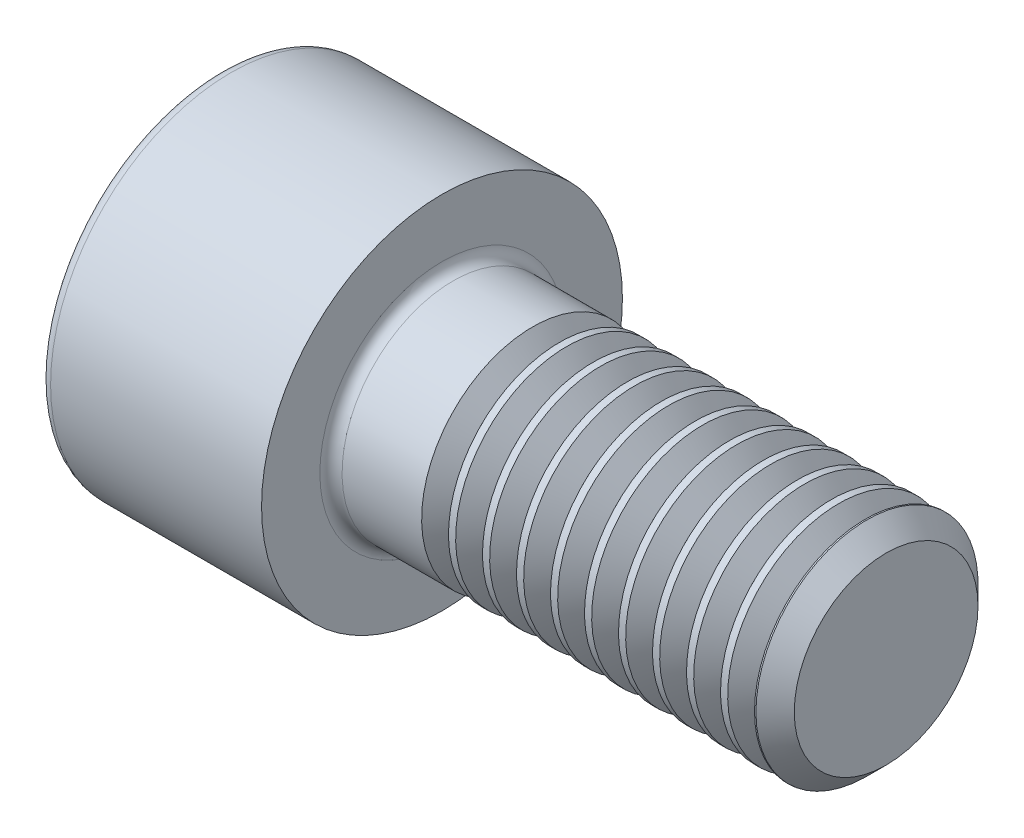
ISO-10303-21;
HEADER;
FILE_DESCRIPTION(('STEP AP214'),'2;1');
FILE_NAME('part.step','',(''),(''),'','','');
FILE_SCHEMA(('AUTOMOTIVE_DESIGN { 1 0 10303 214 1 1 1 1 }'));
ENDSEC;
DATA;
#1=APPLICATION_CONTEXT('core data for automotive mechanical design processes');
#2=APPLICATION_PROTOCOL_DEFINITION('international standard','automotive_design',2000,#1);
#3=PRODUCT_CONTEXT('',#1,'mechanical');
#4=PRODUCT('Part','Part','',(#3));
#5=PRODUCT_RELATED_PRODUCT_CATEGORY('part','',(#4));
#6=PRODUCT_DEFINITION_FORMATION('','',#4);
#7=PRODUCT_DEFINITION_CONTEXT('part definition',#1,'design');
#8=PRODUCT_DEFINITION('design','',#6,#7);
#9=PRODUCT_DEFINITION_SHAPE('','',#8);
#10=(LENGTH_UNIT() NAMED_UNIT(*) SI_UNIT(.MILLI.,.METRE.));
#11=(NAMED_UNIT(*) PLANE_ANGLE_UNIT() SI_UNIT($,.RADIAN.));
#12=(NAMED_UNIT(*) SI_UNIT($,.STERADIAN.) SOLID_ANGLE_UNIT());
#13=UNCERTAINTY_MEASURE_WITH_UNIT(LENGTH_MEASURE(1.E-05),#10,'distance_accuracy_value','');
#14=(GEOMETRIC_REPRESENTATION_CONTEXT(3) GLOBAL_UNCERTAINTY_ASSIGNED_CONTEXT((#13)) GLOBAL_UNIT_ASSIGNED_CONTEXT((#10,
#11,#12)) REPRESENTATION_CONTEXT('',''));
#15=CARTESIAN_POINT('',(0.,0.,0.));
#16=DIRECTION('',(0.,0.,1.));
#17=DIRECTION('',(1.,0.,0.));
#18=AXIS2_PLACEMENT_3D('',#15,#16,#17);
#19=CARTESIAN_POINT('',(0.,0.,0.));
#20=DIRECTION('',(-1.,0.,0.));
#21=DIRECTION('',(0.,0.,1.));
#22=AXIS2_PLACEMENT_3D('',#19,#20,#21);
#23=PLANE('',#22);
#24=DIRECTION('',(0.,-0.499999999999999,0.866025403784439));
#25=VECTOR('',#24,1.);
#26=CARTESIAN_POINT('',(0.,3.51894989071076,0.));
#27=LINE('',#26,#25);
#28=CARTESIAN_POINT('',(0.,3.51894989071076,0.));
#29=VERTEX_POINT('',#28);
#30=CARTESIAN_POINT('',(0.,1.75947494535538,3.04749999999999));
#31=VERTEX_POINT('',#30);
#32=EDGE_CURVE('E408',#29,#31,#27,.T.);
#33=ORIENTED_EDGE('',*,*,#32,.T.);
#34=DIRECTION('',(0.,1.,0.));
#35=VECTOR('',#34,1.);
#36=CARTESIAN_POINT('',(0.,-1.75947494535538,3.0475));
#37=LINE('',#36,#35);
#38=CARTESIAN_POINT('',(0.,-1.75947494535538,3.0475));
#39=VERTEX_POINT('',#38);
#40=EDGE_CURVE('E131',#39,#31,#37,.T.);
#41=ORIENTED_EDGE('',*,*,#40,.F.);
#42=DIRECTION('',(0.,-0.500000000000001,-0.866025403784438));
#43=VECTOR('',#42,1.);
#44=CARTESIAN_POINT('',(0.,-1.75947494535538,3.0475));
#45=LINE('',#44,#43);
#46=CARTESIAN_POINT('',(0.,-3.51894989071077,0.));
#47=VERTEX_POINT('',#46);
#48=EDGE_CURVE('E427',#39,#47,#45,.T.);
#49=ORIENTED_EDGE('',*,*,#48,.T.);
#50=DIRECTION('',(0.,0.499999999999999,-0.866025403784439));
#51=VECTOR('',#50,1.);
#52=CARTESIAN_POINT('',(0.,-3.51894989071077,0.));
#53=LINE('',#52,#51);
#54=CARTESIAN_POINT('',(0.,-1.75947494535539,-3.0475));
#55=VERTEX_POINT('',#54);
#56=EDGE_CURVE('E430',#47,#55,#53,.T.);
#57=ORIENTED_EDGE('',*,*,#56,.T.);
#58=DIRECTION('',(0.,-1.,0.));
#59=VECTOR('',#58,1.);
#60=CARTESIAN_POINT('',(0.,1.75947494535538,-3.0475));
#61=LINE('',#60,#59);
#62=CARTESIAN_POINT('',(0.,1.75947494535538,-3.0475));
#63=VERTEX_POINT('',#62);
#64=EDGE_CURVE('E433',#63,#55,#61,.T.);
#65=ORIENTED_EDGE('',*,*,#64,.F.);
#66=DIRECTION('',(0.,-0.500000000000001,-0.866025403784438));
#67=VECTOR('',#66,1.);
#68=CARTESIAN_POINT('',(0.,3.51894989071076,0.));
#69=LINE('',#68,#67);
#70=EDGE_CURVE('E126',#29,#63,#69,.T.);
#71=ORIENTED_EDGE('',*,*,#70,.F.);
#72=EDGE_LOOP('',(#33,#41,#49,#57,#65,#71));
#73=FACE_BOUND('',#72,.T.);
#74=CARTESIAN_POINT('',(0.,0.,0.));
#75=DIRECTION('',(-1.,0.,0.));
#76=DIRECTION('',(0.,0.,1.));
#77=AXIS2_PLACEMENT_3D('',#74,#75,#76);
#78=CIRCLE('',#77,6.1);
#79=CARTESIAN_POINT('',(0.,0.,6.1));
#80=VERTEX_POINT('',#79);
#81=EDGE_CURVE('E43',#80,#80,#78,.T.);
#82=ORIENTED_EDGE('',*,*,#81,.T.);
#83=EDGE_LOOP('',(#82));
#84=FACE_BOUND('',#83,.T.);
#85=ADVANCED_FACE('F35',(#73,#84),#23,.T.);
#86=CARTESIAN_POINT('',(-31.75,0.,0.));
#87=DIRECTION('',(-1.,0.,0.));
#88=DIRECTION('',(0.,0.,1.));
#89=AXIS2_PLACEMENT_3D('',#86,#87,#88);
#90=CYLINDRICAL_SURFACE('',#89,6.5);
#91=CARTESIAN_POINT('',(0.399999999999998,0.,0.));
#92=DIRECTION('',(-1.,0.,0.));
#93=DIRECTION('',(0.,0.,1.));
#94=AXIS2_PLACEMENT_3D('',#91,#92,#93);
#95=CIRCLE('',#94,6.5);
#96=CARTESIAN_POINT('',(0.399999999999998,0.,6.5));
#97=VERTEX_POINT('',#96);
#98=EDGE_CURVE('E11',#97,#97,#95,.F.);
#99=ORIENTED_EDGE('',*,*,#98,.T.);
#100=EDGE_LOOP('',(#99));
#101=FACE_BOUND('',#100,.T.);
#102=CARTESIAN_POINT('',(8.,0.,0.));
#103=DIRECTION('',(-1.,0.,0.));
#104=DIRECTION('',(0.,0.,1.));
#105=AXIS2_PLACEMENT_3D('',#102,#103,#104);
#106=CIRCLE('',#105,6.5);
#107=CARTESIAN_POINT('',(8.,0.,6.5));
#108=VERTEX_POINT('',#107);
#109=EDGE_CURVE('E149',#108,#108,#106,.T.);
#110=ORIENTED_EDGE('',*,*,#109,.T.);
#111=EDGE_LOOP('',(#110));
#112=FACE_BOUND('',#111,.T.);
#113=ADVANCED_FACE('F173',(#101,#112),#90,.T.);
#114=CARTESIAN_POINT('',(8.,6.5,0.));
#115=DIRECTION('',(1.,0.,0.));
#116=DIRECTION('',(0.,0.,-1.));
#117=AXIS2_PLACEMENT_3D('',#114,#115,#116);
#118=PLANE('',#117);
#119=CARTESIAN_POINT('',(8.,0.,0.));
#120=DIRECTION('',(1.,0.,0.));
#121=DIRECTION('',(0.,0.,-1.));
#122=AXIS2_PLACEMENT_3D('',#119,#120,#121);
#123=CIRCLE('',#122,4.39999999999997);
#124=CARTESIAN_POINT('',(8.,0.,-4.39999999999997));
#125=VERTEX_POINT('',#124);
#126=EDGE_CURVE('E152',#125,#125,#123,.F.);
#127=ORIENTED_EDGE('',*,*,#126,.T.);
#128=EDGE_LOOP('',(#127));
#129=FACE_BOUND('',#128,.T.);
#130=ORIENTED_EDGE('',*,*,#109,.F.);
#131=EDGE_LOOP('',(#130));
#132=FACE_BOUND('',#131,.T.);
#133=ADVANCED_FACE('F179',(#129,#132),#118,.T.);
#134=CARTESIAN_POINT('',(-31.75,0.,0.));
#135=DIRECTION('',(-1.,0.,0.));
#136=DIRECTION('',(0.,0.,1.));
#137=AXIS2_PLACEMENT_3D('',#134,#135,#136);
#138=CYLINDRICAL_SURFACE('',#137,3.99999999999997);
#139=CARTESIAN_POINT('',(11.2665066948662,0.,0.));
#140=DIRECTION('',(-1.,0.,0.));
#141=DIRECTION('',(0.,-1.,0.));
#142=AXIS2_PLACEMENT_3D('',#139,#140,#141);
#143=CIRCLE('',#142,4.);
#144=CARTESIAN_POINT('',(11.2665066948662,-4.,0.));
#145=VERTEX_POINT('',#144);
#146=EDGE_CURVE('E403',#145,#145,#143,.T.);
#147=ORIENTED_EDGE('',*,*,#146,.T.);
#148=EDGE_LOOP('',(#147));
#149=FACE_BOUND('',#148,.T.);
#150=CARTESIAN_POINT('',(8.4,0.,0.));
#151=DIRECTION('',(1.,0.,0.));
#152=DIRECTION('',(0.,0.,-1.));
#153=AXIS2_PLACEMENT_3D('',#150,#151,#152);
#154=CIRCLE('',#153,3.99999999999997);
#155=CARTESIAN_POINT('',(8.4,0.,-3.99999999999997));
#156=VERTEX_POINT('',#155);
#157=EDGE_CURVE('E155',#156,#156,#154,.T.);
#158=ORIENTED_EDGE('',*,*,#157,.T.);
#159=EDGE_LOOP('',(#158));
#160=FACE_BOUND('',#159,.T.);
#161=ADVANCED_FACE('F169',(#149,#160),#138,.T.);
#162=CARTESIAN_POINT('',(8.4,0.,0.));
#163=DIRECTION('',(1.,0.,0.));
#164=DIRECTION('',(0.,0.,-1.));
#165=AXIS2_PLACEMENT_3D('',#162,#163,#164);
#166=TOROIDAL_SURFACE('',#165,4.39999999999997,0.4);
#167=ORIENTED_EDGE('',*,*,#157,.F.);
#168=EDGE_LOOP('',(#167));
#169=FACE_BOUND('',#168,.T.);
#170=ORIENTED_EDGE('',*,*,#126,.F.);
#171=EDGE_LOOP('',(#170));
#172=FACE_BOUND('',#171,.T.);
#173=ADVANCED_FACE('F162',(#169,#172),#166,.F.);
#174=CARTESIAN_POINT('',(0.399999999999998,0.,0.));
#175=DIRECTION('',(-1.,0.,0.));
#176=DIRECTION('',(0.,0.,1.));
#177=AXIS2_PLACEMENT_3D('',#174,#175,#176);
#178=TOROIDAL_SURFACE('',#177,6.1,0.4);
#179=ORIENTED_EDGE('',*,*,#98,.F.);
#180=EDGE_LOOP('',(#179));
#181=FACE_BOUND('',#180,.T.);
#182=ORIENTED_EDGE('',*,*,#81,.F.);
#183=EDGE_LOOP('',(#182));
#184=FACE_BOUND('',#183,.T.);
#185=ADVANCED_FACE('F37',(#181,#184),#178,.T.);
#186=CARTESIAN_POINT('',(4.,3.51894989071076,0.));
#187=DIRECTION('',(0.,-0.866025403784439,-0.499999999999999));
#188=DIRECTION('',(0.,0.499999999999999,-0.866025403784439));
#189=AXIS2_PLACEMENT_3D('',#186,#187,#188);
#190=PLANE('',#189);
#191=ORIENTED_EDGE('',*,*,#32,.F.);
#192=DIRECTION('',(-1.,0.,0.));
#193=VECTOR('',#192,1.);
#194=CARTESIAN_POINT('',(4.,3.51894989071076,0.));
#195=LINE('',#194,#193);
#196=CARTESIAN_POINT('',(4.,3.51894989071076,0.));
#197=VERTEX_POINT('',#196);
#198=EDGE_CURVE('E424',#197,#29,#195,.T.);
#199=ORIENTED_EDGE('',*,*,#198,.F.);
#200=DIRECTION('',(0.,-0.499999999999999,0.866025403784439));
#201=VECTOR('',#200,1.);
#202=CARTESIAN_POINT('',(4.,3.51894989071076,0.));
#203=LINE('',#202,#201);
#204=CARTESIAN_POINT('',(4.,2.63921241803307,1.52374999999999));
#205=VERTEX_POINT('',#204);
#206=EDGE_CURVE('E118',#197,#205,#203,.T.);
#207=ORIENTED_EDGE('',*,*,#206,.T.);
#208=CARTESIAN_POINT('',(4.,1.75947494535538,3.04749999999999));
#209=VERTEX_POINT('',#208);
#210=EDGE_CURVE('E109',#205,#209,#203,.T.);
#211=ORIENTED_EDGE('',*,*,#210,.T.);
#212=DIRECTION('',(-1.,0.,0.));
#213=VECTOR('',#212,1.);
#214=CARTESIAN_POINT('',(4.,1.75947494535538,3.04749999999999));
#215=LINE('',#214,#213);
#216=EDGE_CURVE('E123',#209,#31,#215,.T.);
#217=ORIENTED_EDGE('',*,*,#216,.T.);
#218=EDGE_LOOP('',(#191,#199,#207,#211,#217));
#219=FACE_BOUND('',#218,.T.);
#220=ADVANCED_FACE('F122',(#219),#190,.T.);
#221=CARTESIAN_POINT('',(4.,-1.75947494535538,3.0475));
#222=DIRECTION('',(0.,0.,1.));
#223=DIRECTION('',(0.,-1.,0.));
#224=AXIS2_PLACEMENT_3D('',#221,#222,#223);
#225=PLANE('',#224);
#226=ORIENTED_EDGE('',*,*,#40,.T.);
#227=ORIENTED_EDGE('',*,*,#216,.F.);
#228=DIRECTION('',(0.,1.,0.));
#229=VECTOR('',#228,1.);
#230=CARTESIAN_POINT('',(4.,-1.75947494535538,3.0475));
#231=LINE('',#230,#229);
#232=CARTESIAN_POINT('',(4.,0.,3.0475));
#233=VERTEX_POINT('',#232);
#234=EDGE_CURVE('E106',#233,#209,#231,.T.);
#235=ORIENTED_EDGE('',*,*,#234,.F.);
#236=CARTESIAN_POINT('',(4.,-1.75947494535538,3.0475));
#237=VERTEX_POINT('',#236);
#238=EDGE_CURVE('E117',#237,#233,#231,.T.);
#239=ORIENTED_EDGE('',*,*,#238,.F.);
#240=DIRECTION('',(-1.,0.,0.));
#241=VECTOR('',#240,1.);
#242=CARTESIAN_POINT('',(4.,-1.75947494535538,3.0475));
#243=LINE('',#242,#241);
#244=EDGE_CURVE('E133',#237,#39,#243,.T.);
#245=ORIENTED_EDGE('',*,*,#244,.T.);
#246=EDGE_LOOP('',(#226,#227,#235,#239,#245));
#247=FACE_BOUND('',#246,.T.);
#248=ADVANCED_FACE('F128',(#247),#225,.F.);
#249=CARTESIAN_POINT('',(4.,-1.75947494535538,3.0475));
#250=DIRECTION('',(0.,0.866025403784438,-0.500000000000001));
#251=DIRECTION('',(0.,0.500000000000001,0.866025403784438));
#252=AXIS2_PLACEMENT_3D('',#249,#250,#251);
#253=PLANE('',#252);
#254=ORIENTED_EDGE('',*,*,#48,.F.);
#255=ORIENTED_EDGE('',*,*,#244,.F.);
#256=DIRECTION('',(0.,-0.500000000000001,-0.866025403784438));
#257=VECTOR('',#256,1.);
#258=CARTESIAN_POINT('',(4.,-1.75947494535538,3.0475));
#259=LINE('',#258,#257);
#260=CARTESIAN_POINT('',(4.,-2.63921241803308,1.52375));
#261=VERTEX_POINT('',#260);
#262=EDGE_CURVE('E411',#237,#261,#259,.T.);
#263=ORIENTED_EDGE('',*,*,#262,.T.);
#264=CARTESIAN_POINT('',(4.,-3.51894989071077,0.));
#265=VERTEX_POINT('',#264);
#266=EDGE_CURVE('E410',#261,#265,#259,.T.);
#267=ORIENTED_EDGE('',*,*,#266,.T.);
#268=DIRECTION('',(-1.,0.,0.));
#269=VECTOR('',#268,1.);
#270=CARTESIAN_POINT('',(4.,-3.51894989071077,0.));
#271=LINE('',#270,#269);
#272=EDGE_CURVE('E138',#265,#47,#271,.T.);
#273=ORIENTED_EDGE('',*,*,#272,.T.);
#274=EDGE_LOOP('',(#254,#255,#263,#267,#273));
#275=FACE_BOUND('',#274,.T.);
#276=ADVANCED_FACE('F207',(#275),#253,.T.);
#277=CARTESIAN_POINT('',(4.,-3.51894989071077,0.));
#278=DIRECTION('',(0.,0.866025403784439,0.499999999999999));
#279=DIRECTION('',(0.,-0.499999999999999,0.866025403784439));
#280=AXIS2_PLACEMENT_3D('',#277,#278,#279);
#281=PLANE('',#280);
#282=ORIENTED_EDGE('',*,*,#56,.F.);
#283=ORIENTED_EDGE('',*,*,#272,.F.);
#284=DIRECTION('',(0.,0.499999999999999,-0.866025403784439));
#285=VECTOR('',#284,1.);
#286=CARTESIAN_POINT('',(4.,-3.51894989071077,0.));
#287=LINE('',#286,#285);
#288=CARTESIAN_POINT('',(4.,-2.63921241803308,-1.52375));
#289=VERTEX_POINT('',#288);
#290=EDGE_CURVE('E415',#265,#289,#287,.T.);
#291=ORIENTED_EDGE('',*,*,#290,.T.);
#292=CARTESIAN_POINT('',(4.,-1.75947494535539,-3.0475));
#293=VERTEX_POINT('',#292);
#294=EDGE_CURVE('E414',#289,#293,#287,.T.);
#295=ORIENTED_EDGE('',*,*,#294,.T.);
#296=DIRECTION('',(-1.,0.,0.));
#297=VECTOR('',#296,1.);
#298=CARTESIAN_POINT('',(4.,-1.75947494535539,-3.0475));
#299=LINE('',#298,#297);
#300=EDGE_CURVE('E442',#293,#55,#299,.T.);
#301=ORIENTED_EDGE('',*,*,#300,.T.);
#302=EDGE_LOOP('',(#282,#283,#291,#295,#301));
#303=FACE_BOUND('',#302,.T.);
#304=ADVANCED_FACE('F210',(#303),#281,.T.);
#305=CARTESIAN_POINT('',(4.,1.75947494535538,-3.0475));
#306=DIRECTION('',(0.,0.,-1.));
#307=DIRECTION('',(0.,1.,0.));
#308=AXIS2_PLACEMENT_3D('',#305,#306,#307);
#309=PLANE('',#308);
#310=ORIENTED_EDGE('',*,*,#64,.T.);
#311=ORIENTED_EDGE('',*,*,#300,.F.);
#312=DIRECTION('',(0.,-1.,0.));
#313=VECTOR('',#312,1.);
#314=CARTESIAN_POINT('',(4.,1.75947494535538,-3.0475));
#315=LINE('',#314,#313);
#316=CARTESIAN_POINT('',(4.,0.,-3.0475));
#317=VERTEX_POINT('',#316);
#318=EDGE_CURVE('E418',#317,#293,#315,.T.);
#319=ORIENTED_EDGE('',*,*,#318,.F.);
#320=CARTESIAN_POINT('',(4.,1.75947494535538,-3.0475));
#321=VERTEX_POINT('',#320);
#322=EDGE_CURVE('E50',#321,#317,#315,.T.);
#323=ORIENTED_EDGE('',*,*,#322,.F.);
#324=DIRECTION('',(-1.,0.,0.));
#325=VECTOR('',#324,1.);
#326=CARTESIAN_POINT('',(4.,1.75947494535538,-3.0475));
#327=LINE('',#326,#325);
#328=EDGE_CURVE('E439',#321,#63,#327,.T.);
#329=ORIENTED_EDGE('',*,*,#328,.T.);
#330=EDGE_LOOP('',(#310,#311,#319,#323,#329));
#331=FACE_BOUND('',#330,.T.);
#332=ADVANCED_FACE('F214',(#331),#309,.F.);
#333=CARTESIAN_POINT('',(4.,3.51894989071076,0.));
#334=DIRECTION('',(0.,0.866025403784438,-0.500000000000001));
#335=DIRECTION('',(0.,0.500000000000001,0.866025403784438));
#336=AXIS2_PLACEMENT_3D('',#333,#334,#335);
#337=PLANE('',#336);
#338=ORIENTED_EDGE('',*,*,#70,.T.);
#339=ORIENTED_EDGE('',*,*,#328,.F.);
#340=DIRECTION('',(0.,-0.500000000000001,-0.866025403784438));
#341=VECTOR('',#340,1.);
#342=CARTESIAN_POINT('',(4.,3.51894989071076,0.));
#343=LINE('',#342,#341);
#344=CARTESIAN_POINT('',(4.,2.63921241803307,-1.52375));
#345=VERTEX_POINT('',#344);
#346=EDGE_CURVE('E420',#345,#321,#343,.T.);
#347=ORIENTED_EDGE('',*,*,#346,.F.);
#348=EDGE_CURVE('E421',#197,#345,#343,.T.);
#349=ORIENTED_EDGE('',*,*,#348,.F.);
#350=ORIENTED_EDGE('',*,*,#198,.T.);
#351=EDGE_LOOP('',(#338,#339,#347,#349,#350));
#352=FACE_BOUND('',#351,.T.);
#353=ADVANCED_FACE('F218',(#352),#337,.F.);
#354=CARTESIAN_POINT('',(4.,3.51894989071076,0.));
#355=DIRECTION('',(1.,0.,0.));
#356=DIRECTION('',(0.,0.,-1.));
#357=AXIS2_PLACEMENT_3D('',#354,#355,#356);
#358=PLANE('',#357);
#359=ORIENTED_EDGE('',*,*,#318,.T.);
#360=ORIENTED_EDGE('',*,*,#294,.F.);
#361=CARTESIAN_POINT('',(4.,0.,0.));
#362=DIRECTION('',(-1.,0.,0.));
#363=DIRECTION('',(0.,0.,1.));
#364=AXIS2_PLACEMENT_3D('',#361,#362,#363);
#365=CIRCLE('',#364,3.0475);
#366=EDGE_CURVE('E459',#317,#289,#365,.T.);
#367=ORIENTED_EDGE('',*,*,#366,.F.);
#368=EDGE_LOOP('',(#359,#360,#367));
#369=FACE_BOUND('',#368,.T.);
#370=ADVANCED_FACE('F222',(#369),#358,.F.);
#371=ORIENTED_EDGE('',*,*,#290,.F.);
#372=ORIENTED_EDGE('',*,*,#266,.F.);
#373=EDGE_CURVE('E136',#289,#261,#365,.T.);
#374=ORIENTED_EDGE('',*,*,#373,.F.);
#375=EDGE_LOOP('',(#371,#372,#374));
#376=FACE_BOUND('',#375,.T.);
#377=ADVANCED_FACE('F226',(#376),#358,.F.);
#378=ORIENTED_EDGE('',*,*,#262,.F.);
#379=ORIENTED_EDGE('',*,*,#238,.T.);
#380=EDGE_CURVE('E132',#261,#233,#365,.T.);
#381=ORIENTED_EDGE('',*,*,#380,.F.);
#382=EDGE_LOOP('',(#378,#379,#381));
#383=FACE_BOUND('',#382,.T.);
#384=ADVANCED_FACE('F468',(#383),#358,.F.);
#385=ORIENTED_EDGE('',*,*,#234,.T.);
#386=ORIENTED_EDGE('',*,*,#210,.F.);
#387=EDGE_CURVE('E112',#233,#205,#365,.T.);
#388=ORIENTED_EDGE('',*,*,#387,.F.);
#389=EDGE_LOOP('',(#385,#386,#388));
#390=FACE_BOUND('',#389,.T.);
#391=ADVANCED_FACE('F108',(#390),#358,.F.);
#392=ORIENTED_EDGE('',*,*,#206,.F.);
#393=ORIENTED_EDGE('',*,*,#348,.T.);
#394=EDGE_CURVE('E143',#205,#345,#365,.T.);
#395=ORIENTED_EDGE('',*,*,#394,.F.);
#396=EDGE_LOOP('',(#392,#393,#395));
#397=FACE_BOUND('',#396,.T.);
#398=ADVANCED_FACE('F454',(#397),#358,.F.);
#399=ORIENTED_EDGE('',*,*,#346,.T.);
#400=ORIENTED_EDGE('',*,*,#322,.T.);
#401=EDGE_CURVE('E458',#345,#317,#365,.T.);
#402=ORIENTED_EDGE('',*,*,#401,.F.);
#403=EDGE_LOOP('',(#399,#400,#402));
#404=FACE_BOUND('',#403,.T.);
#405=ADVANCED_FACE('F203',(#404),#358,.F.);
#406=CARTESIAN_POINT('',(4.,0.,0.));
#407=DIRECTION('',(-1.,0.,0.));
#408=DIRECTION('',(0.,0.,1.));
#409=AXIS2_PLACEMENT_3D('',#406,#407,#408);
#410=CONICAL_SURFACE('',#409,3.0475,1.04719755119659);
#411=CARTESIAN_POINT('',(5.75947494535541,0.,0.));
#412=VERTEX_POINT('',#411);
#413=VERTEX_LOOP('',#412);
#414=FACE_BOUND('',#413,.T.);
#415=ORIENTED_EDGE('',*,*,#387,.T.);
#416=ORIENTED_EDGE('',*,*,#394,.T.);
#417=ORIENTED_EDGE('',*,*,#401,.T.);
#418=ORIENTED_EDGE('',*,*,#366,.T.);
#419=ORIENTED_EDGE('',*,*,#373,.T.);
#420=ORIENTED_EDGE('',*,*,#380,.T.);
#421=EDGE_LOOP('',(#415,#416,#417,#418,#419,#420));
#422=FACE_BOUND('',#421,.T.);
#423=ADVANCED_FACE('F200',(#414,#422),#410,.F.);
#424=CARTESIAN_POINT('',(12.2334933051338,0.,0.));
#425=DIRECTION('',(1.,0.,0.));
#426=DIRECTION('',(0.,1.,0.));
#427=AXIS2_PLACEMENT_3D('',#424,#425,#426);
#428=CONICAL_SURFACE('',#427,4.,0.959931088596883);
#429=CARTESIAN_POINT('',(11.75,0.,0.));
#430=DIRECTION('',(-1.,0.,0.));
#431=DIRECTION('',(0.,-1.,0.));
#432=AXIS2_PLACEMENT_3D('',#429,#430,#431);
#433=CIRCLE('',#432,3.3095);
#434=CARTESIAN_POINT('',(11.75,-3.3095,0.));
#435=VERTEX_POINT('',#434);
#436=EDGE_CURVE('E400',#435,#435,#433,.T.);
#437=ORIENTED_EDGE('',*,*,#436,.F.);
#438=EDGE_LOOP('',(#437));
#439=FACE_BOUND('',#438,.T.);
#440=CARTESIAN_POINT('',(12.2334933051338,0.,0.));
#441=DIRECTION('',(-1.,0.,0.));
#442=DIRECTION('',(0.,-1.,0.));
#443=AXIS2_PLACEMENT_3D('',#440,#441,#442);
#444=CIRCLE('',#443,4.);
#445=CARTESIAN_POINT('',(12.2334933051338,-4.,0.));
#446=VERTEX_POINT('',#445);
#447=EDGE_CURVE('E406',#446,#446,#444,.T.);
#448=ORIENTED_EDGE('',*,*,#447,.T.);
#449=EDGE_LOOP('',(#448));
#450=FACE_BOUND('',#449,.T.);
#451=ADVANCED_FACE('F202',(#439,#450),#428,.T.);
#452=CARTESIAN_POINT('',(11.75,0.,0.));
#453=DIRECTION('',(-1.,0.,0.));
#454=DIRECTION('',(0.,-1.,0.));
#455=AXIS2_PLACEMENT_3D('',#452,#453,#454);
#456=CONICAL_SURFACE('',#455,3.3095,0.959931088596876);
#457=ORIENTED_EDGE('',*,*,#146,.F.);
#458=EDGE_LOOP('',(#457));
#459=FACE_BOUND('',#458,.T.);
#460=ORIENTED_EDGE('',*,*,#436,.T.);
#461=EDGE_LOOP('',(#460));
#462=FACE_BOUND('',#461,.T.);
#463=ADVANCED_FACE('F230',(#459,#462),#456,.T.);
#464=CARTESIAN_POINT('',(12.4915066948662,0.,0.));
#465=DIRECTION('',(-1.,0.,0.));
#466=DIRECTION('',(0.,-1.,0.));
#467=AXIS2_PLACEMENT_3D('',#464,#465,#466);
#468=CIRCLE('',#467,4.);
#469=CARTESIAN_POINT('',(12.4915066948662,-4.,0.));
#470=VERTEX_POINT('',#469);
#471=EDGE_CURVE('E394',#470,#470,#468,.T.);
#472=ORIENTED_EDGE('',*,*,#471,.T.);
#473=EDGE_LOOP('',(#472));
#474=FACE_BOUND('',#473,.T.);
#475=ORIENTED_EDGE('',*,*,#447,.F.);
#476=EDGE_LOOP('',(#475));
#477=FACE_BOUND('',#476,.T.);
#478=ADVANCED_FACE('F190',(#474,#477),#138,.T.);
#479=CARTESIAN_POINT('',(13.4584933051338,0.,0.));
#480=DIRECTION('',(1.,0.,0.));
#481=DIRECTION('',(0.,1.,0.));
#482=AXIS2_PLACEMENT_3D('',#479,#480,#481);
#483=CONICAL_SURFACE('',#482,4.,0.959931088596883);
#484=CARTESIAN_POINT('',(12.975,0.,0.));
#485=DIRECTION('',(-1.,0.,0.));
#486=DIRECTION('',(0.,-1.,0.));
#487=AXIS2_PLACEMENT_3D('',#484,#485,#486);
#488=CIRCLE('',#487,3.3095);
#489=CARTESIAN_POINT('',(12.975,-3.3095,0.));
#490=VERTEX_POINT('',#489);
#491=EDGE_CURVE('E391',#490,#490,#488,.T.);
#492=ORIENTED_EDGE('',*,*,#491,.F.);
#493=EDGE_LOOP('',(#492));
#494=FACE_BOUND('',#493,.T.);
#495=CARTESIAN_POINT('',(13.4584933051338,0.,0.));
#496=DIRECTION('',(-1.,0.,0.));
#497=DIRECTION('',(0.,-1.,0.));
#498=AXIS2_PLACEMENT_3D('',#495,#496,#497);
#499=CIRCLE('',#498,4.);
#500=CARTESIAN_POINT('',(13.4584933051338,-4.,0.));
#501=VERTEX_POINT('',#500);
#502=EDGE_CURVE('E397',#501,#501,#499,.T.);
#503=ORIENTED_EDGE('',*,*,#502,.T.);
#504=EDGE_LOOP('',(#503));
#505=FACE_BOUND('',#504,.T.);
#506=ADVANCED_FACE('F235',(#494,#505),#483,.T.);
#507=CARTESIAN_POINT('',(12.975,0.,0.));
#508=DIRECTION('',(-1.,0.,0.));
#509=DIRECTION('',(0.,-1.,0.));
#510=AXIS2_PLACEMENT_3D('',#507,#508,#509);
#511=CONICAL_SURFACE('',#510,3.3095,0.959931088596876);
#512=ORIENTED_EDGE('',*,*,#471,.F.);
#513=EDGE_LOOP('',(#512));
#514=FACE_BOUND('',#513,.T.);
#515=ORIENTED_EDGE('',*,*,#491,.T.);
#516=EDGE_LOOP('',(#515));
#517=FACE_BOUND('',#516,.T.);
#518=ADVANCED_FACE('F238',(#514,#517),#511,.T.);
#519=CARTESIAN_POINT('',(13.7165066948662,0.,0.));
#520=DIRECTION('',(-1.,0.,0.));
#521=DIRECTION('',(0.,-1.,0.));
#522=AXIS2_PLACEMENT_3D('',#519,#520,#521);
#523=CIRCLE('',#522,4.);
#524=CARTESIAN_POINT('',(13.7165066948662,-4.,0.));
#525=VERTEX_POINT('',#524);
#526=EDGE_CURVE('E385',#525,#525,#523,.T.);
#527=ORIENTED_EDGE('',*,*,#526,.T.);
#528=EDGE_LOOP('',(#527));
#529=FACE_BOUND('',#528,.T.);
#530=ORIENTED_EDGE('',*,*,#502,.F.);
#531=EDGE_LOOP('',(#530));
#532=FACE_BOUND('',#531,.T.);
#533=ADVANCED_FACE('F242',(#529,#532),#138,.T.);
#534=CARTESIAN_POINT('',(14.6834933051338,0.,0.));
#535=DIRECTION('',(1.,0.,0.));
#536=DIRECTION('',(0.,1.,0.));
#537=AXIS2_PLACEMENT_3D('',#534,#535,#536);
#538=CONICAL_SURFACE('',#537,4.,0.959931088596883);
#539=CARTESIAN_POINT('',(14.2,0.,0.));
#540=DIRECTION('',(-1.,0.,0.));
#541=DIRECTION('',(0.,-1.,0.));
#542=AXIS2_PLACEMENT_3D('',#539,#540,#541);
#543=CIRCLE('',#542,3.3095);
#544=CARTESIAN_POINT('',(14.2,-3.3095,0.));
#545=VERTEX_POINT('',#544);
#546=EDGE_CURVE('E382',#545,#545,#543,.T.);
#547=ORIENTED_EDGE('',*,*,#546,.F.);
#548=EDGE_LOOP('',(#547));
#549=FACE_BOUND('',#548,.T.);
#550=CARTESIAN_POINT('',(14.6834933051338,0.,0.));
#551=DIRECTION('',(-1.,0.,0.));
#552=DIRECTION('',(0.,-1.,0.));
#553=AXIS2_PLACEMENT_3D('',#550,#551,#552);
#554=CIRCLE('',#553,4.);
#555=CARTESIAN_POINT('',(14.6834933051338,-4.,0.));
#556=VERTEX_POINT('',#555);
#557=EDGE_CURVE('E388',#556,#556,#554,.T.);
#558=ORIENTED_EDGE('',*,*,#557,.T.);
#559=EDGE_LOOP('',(#558));
#560=FACE_BOUND('',#559,.T.);
#561=ADVANCED_FACE('F244',(#549,#560),#538,.T.);
#562=CARTESIAN_POINT('',(14.2,0.,0.));
#563=DIRECTION('',(-1.,0.,0.));
#564=DIRECTION('',(0.,-1.,0.));
#565=AXIS2_PLACEMENT_3D('',#562,#563,#564);
#566=CONICAL_SURFACE('',#565,3.3095,0.959931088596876);
#567=ORIENTED_EDGE('',*,*,#526,.F.);
#568=EDGE_LOOP('',(#567));
#569=FACE_BOUND('',#568,.T.);
#570=ORIENTED_EDGE('',*,*,#546,.T.);
#571=EDGE_LOOP('',(#570));
#572=FACE_BOUND('',#571,.T.);
#573=ADVANCED_FACE('F247',(#569,#572),#566,.T.);
#574=CARTESIAN_POINT('',(14.9415066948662,0.,0.));
#575=DIRECTION('',(-1.,0.,0.));
#576=DIRECTION('',(0.,-1.,0.));
#577=AXIS2_PLACEMENT_3D('',#574,#575,#576);
#578=CIRCLE('',#577,4.);
#579=CARTESIAN_POINT('',(14.9415066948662,-4.,0.));
#580=VERTEX_POINT('',#579);
#581=EDGE_CURVE('E376',#580,#580,#578,.T.);
#582=ORIENTED_EDGE('',*,*,#581,.T.);
#583=EDGE_LOOP('',(#582));
#584=FACE_BOUND('',#583,.T.);
#585=ORIENTED_EDGE('',*,*,#557,.F.);
#586=EDGE_LOOP('',(#585));
#587=FACE_BOUND('',#586,.T.);
#588=ADVANCED_FACE('F251',(#584,#587),#138,.T.);
#589=CARTESIAN_POINT('',(15.9084933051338,0.,0.));
#590=DIRECTION('',(1.,0.,0.));
#591=DIRECTION('',(0.,1.,0.));
#592=AXIS2_PLACEMENT_3D('',#589,#590,#591);
#593=CONICAL_SURFACE('',#592,4.,0.959931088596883);
#594=CARTESIAN_POINT('',(15.425,0.,0.));
#595=DIRECTION('',(-1.,0.,0.));
#596=DIRECTION('',(0.,-1.,0.));
#597=AXIS2_PLACEMENT_3D('',#594,#595,#596);
#598=CIRCLE('',#597,3.3095);
#599=CARTESIAN_POINT('',(15.425,-3.3095,0.));
#600=VERTEX_POINT('',#599);
#601=EDGE_CURVE('E373',#600,#600,#598,.T.);
#602=ORIENTED_EDGE('',*,*,#601,.F.);
#603=EDGE_LOOP('',(#602));
#604=FACE_BOUND('',#603,.T.);
#605=CARTESIAN_POINT('',(15.9084933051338,0.,0.));
#606=DIRECTION('',(-1.,0.,0.));
#607=DIRECTION('',(0.,-1.,0.));
#608=AXIS2_PLACEMENT_3D('',#605,#606,#607);
#609=CIRCLE('',#608,4.);
#610=CARTESIAN_POINT('',(15.9084933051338,-4.,0.));
#611=VERTEX_POINT('',#610);
#612=EDGE_CURVE('E379',#611,#611,#609,.T.);
#613=ORIENTED_EDGE('',*,*,#612,.T.);
#614=EDGE_LOOP('',(#613));
#615=FACE_BOUND('',#614,.T.);
#616=ADVANCED_FACE('F253',(#604,#615),#593,.T.);
#617=CARTESIAN_POINT('',(15.425,0.,0.));
#618=DIRECTION('',(-1.,0.,0.));
#619=DIRECTION('',(0.,-1.,0.));
#620=AXIS2_PLACEMENT_3D('',#617,#618,#619);
#621=CONICAL_SURFACE('',#620,3.3095,0.959931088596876);
#622=ORIENTED_EDGE('',*,*,#581,.F.);
#623=EDGE_LOOP('',(#622));
#624=FACE_BOUND('',#623,.T.);
#625=ORIENTED_EDGE('',*,*,#601,.T.);
#626=EDGE_LOOP('',(#625));
#627=FACE_BOUND('',#626,.T.);
#628=ADVANCED_FACE('F256',(#624,#627),#621,.T.);
#629=CARTESIAN_POINT('',(16.1665066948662,0.,0.));
#630=DIRECTION('',(-1.,0.,0.));
#631=DIRECTION('',(0.,-1.,0.));
#632=AXIS2_PLACEMENT_3D('',#629,#630,#631);
#633=CIRCLE('',#632,4.);
#634=CARTESIAN_POINT('',(16.1665066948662,-4.,0.));
#635=VERTEX_POINT('',#634);
#636=EDGE_CURVE('E367',#635,#635,#633,.T.);
#637=ORIENTED_EDGE('',*,*,#636,.T.);
#638=EDGE_LOOP('',(#637));
#639=FACE_BOUND('',#638,.T.);
#640=ORIENTED_EDGE('',*,*,#612,.F.);
#641=EDGE_LOOP('',(#640));
#642=FACE_BOUND('',#641,.T.);
#643=ADVANCED_FACE('F260',(#639,#642),#138,.T.);
#644=CARTESIAN_POINT('',(17.1334933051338,0.,0.));
#645=DIRECTION('',(1.,0.,0.));
#646=DIRECTION('',(0.,1.,0.));
#647=AXIS2_PLACEMENT_3D('',#644,#645,#646);
#648=CONICAL_SURFACE('',#647,4.,0.959931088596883);
#649=CARTESIAN_POINT('',(16.65,0.,0.));
#650=DIRECTION('',(-1.,0.,0.));
#651=DIRECTION('',(0.,-1.,0.));
#652=AXIS2_PLACEMENT_3D('',#649,#650,#651);
#653=CIRCLE('',#652,3.3095);
#654=CARTESIAN_POINT('',(16.65,-3.3095,0.));
#655=VERTEX_POINT('',#654);
#656=EDGE_CURVE('E364',#655,#655,#653,.T.);
#657=ORIENTED_EDGE('',*,*,#656,.F.);
#658=EDGE_LOOP('',(#657));
#659=FACE_BOUND('',#658,.T.);
#660=CARTESIAN_POINT('',(17.1334933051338,0.,0.));
#661=DIRECTION('',(-1.,0.,0.));
#662=DIRECTION('',(0.,-1.,0.));
#663=AXIS2_PLACEMENT_3D('',#660,#661,#662);
#664=CIRCLE('',#663,4.);
#665=CARTESIAN_POINT('',(17.1334933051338,-4.,0.));
#666=VERTEX_POINT('',#665);
#667=EDGE_CURVE('E370',#666,#666,#664,.T.);
#668=ORIENTED_EDGE('',*,*,#667,.T.);
#669=EDGE_LOOP('',(#668));
#670=FACE_BOUND('',#669,.T.);
#671=ADVANCED_FACE('F262',(#659,#670),#648,.T.);
#672=CARTESIAN_POINT('',(16.65,0.,0.));
#673=DIRECTION('',(-1.,0.,0.));
#674=DIRECTION('',(0.,-1.,0.));
#675=AXIS2_PLACEMENT_3D('',#672,#673,#674);
#676=CONICAL_SURFACE('',#675,3.3095,0.959931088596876);
#677=ORIENTED_EDGE('',*,*,#636,.F.);
#678=EDGE_LOOP('',(#677));
#679=FACE_BOUND('',#678,.T.);
#680=ORIENTED_EDGE('',*,*,#656,.T.);
#681=EDGE_LOOP('',(#680));
#682=FACE_BOUND('',#681,.T.);
#683=ADVANCED_FACE('F265',(#679,#682),#676,.T.);
#684=CARTESIAN_POINT('',(17.3915066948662,0.,0.));
#685=DIRECTION('',(-1.,0.,0.));
#686=DIRECTION('',(0.,-1.,0.));
#687=AXIS2_PLACEMENT_3D('',#684,#685,#686);
#688=CIRCLE('',#687,4.);
#689=CARTESIAN_POINT('',(17.3915066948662,-4.,0.));
#690=VERTEX_POINT('',#689);
#691=EDGE_CURVE('E358',#690,#690,#688,.T.);
#692=ORIENTED_EDGE('',*,*,#691,.T.);
#693=EDGE_LOOP('',(#692));
#694=FACE_BOUND('',#693,.T.);
#695=ORIENTED_EDGE('',*,*,#667,.F.);
#696=EDGE_LOOP('',(#695));
#697=FACE_BOUND('',#696,.T.);
#698=ADVANCED_FACE('F269',(#694,#697),#138,.T.);
#699=CARTESIAN_POINT('',(18.3584933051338,0.,0.));
#700=DIRECTION('',(1.,0.,0.));
#701=DIRECTION('',(0.,1.,0.));
#702=AXIS2_PLACEMENT_3D('',#699,#700,#701);
#703=CONICAL_SURFACE('',#702,4.,0.959931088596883);
#704=CARTESIAN_POINT('',(17.875,0.,0.));
#705=DIRECTION('',(-1.,0.,0.));
#706=DIRECTION('',(0.,-1.,0.));
#707=AXIS2_PLACEMENT_3D('',#704,#705,#706);
#708=CIRCLE('',#707,3.3095);
#709=CARTESIAN_POINT('',(17.875,-3.3095,0.));
#710=VERTEX_POINT('',#709);
#711=EDGE_CURVE('E355',#710,#710,#708,.T.);
#712=ORIENTED_EDGE('',*,*,#711,.F.);
#713=EDGE_LOOP('',(#712));
#714=FACE_BOUND('',#713,.T.);
#715=CARTESIAN_POINT('',(18.3584933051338,0.,0.));
#716=DIRECTION('',(-1.,0.,0.));
#717=DIRECTION('',(0.,-1.,0.));
#718=AXIS2_PLACEMENT_3D('',#715,#716,#717);
#719=CIRCLE('',#718,4.);
#720=CARTESIAN_POINT('',(18.3584933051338,-4.,0.));
#721=VERTEX_POINT('',#720);
#722=EDGE_CURVE('E361',#721,#721,#719,.T.);
#723=ORIENTED_EDGE('',*,*,#722,.T.);
#724=EDGE_LOOP('',(#723));
#725=FACE_BOUND('',#724,.T.);
#726=ADVANCED_FACE('F271',(#714,#725),#703,.T.);
#727=CARTESIAN_POINT('',(17.875,0.,0.));
#728=DIRECTION('',(-1.,0.,0.));
#729=DIRECTION('',(0.,-1.,0.));
#730=AXIS2_PLACEMENT_3D('',#727,#728,#729);
#731=CONICAL_SURFACE('',#730,3.3095,0.959931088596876);
#732=ORIENTED_EDGE('',*,*,#691,.F.);
#733=EDGE_LOOP('',(#732));
#734=FACE_BOUND('',#733,.T.);
#735=ORIENTED_EDGE('',*,*,#711,.T.);
#736=EDGE_LOOP('',(#735));
#737=FACE_BOUND('',#736,.T.);
#738=ADVANCED_FACE('F274',(#734,#737),#731,.T.);
#739=CARTESIAN_POINT('',(18.6165066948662,0.,0.));
#740=DIRECTION('',(-1.,0.,0.));
#741=DIRECTION('',(0.,-1.,0.));
#742=AXIS2_PLACEMENT_3D('',#739,#740,#741);
#743=CIRCLE('',#742,4.);
#744=CARTESIAN_POINT('',(18.6165066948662,-4.,0.));
#745=VERTEX_POINT('',#744);
#746=EDGE_CURVE('E349',#745,#745,#743,.T.);
#747=ORIENTED_EDGE('',*,*,#746,.T.);
#748=EDGE_LOOP('',(#747));
#749=FACE_BOUND('',#748,.T.);
#750=ORIENTED_EDGE('',*,*,#722,.F.);
#751=EDGE_LOOP('',(#750));
#752=FACE_BOUND('',#751,.T.);
#753=ADVANCED_FACE('F278',(#749,#752),#138,.T.);
#754=CARTESIAN_POINT('',(19.5834933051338,0.,0.));
#755=DIRECTION('',(1.,0.,0.));
#756=DIRECTION('',(0.,1.,0.));
#757=AXIS2_PLACEMENT_3D('',#754,#755,#756);
#758=CONICAL_SURFACE('',#757,4.,0.959931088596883);
#759=CARTESIAN_POINT('',(19.1,0.,0.));
#760=DIRECTION('',(-1.,0.,0.));
#761=DIRECTION('',(0.,-1.,0.));
#762=AXIS2_PLACEMENT_3D('',#759,#760,#761);
#763=CIRCLE('',#762,3.3095);
#764=CARTESIAN_POINT('',(19.1,-3.3095,0.));
#765=VERTEX_POINT('',#764);
#766=EDGE_CURVE('E346',#765,#765,#763,.T.);
#767=ORIENTED_EDGE('',*,*,#766,.F.);
#768=EDGE_LOOP('',(#767));
#769=FACE_BOUND('',#768,.T.);
#770=CARTESIAN_POINT('',(19.5834933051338,0.,0.));
#771=DIRECTION('',(-1.,0.,0.));
#772=DIRECTION('',(0.,-1.,0.));
#773=AXIS2_PLACEMENT_3D('',#770,#771,#772);
#774=CIRCLE('',#773,4.);
#775=CARTESIAN_POINT('',(19.5834933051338,-4.,0.));
#776=VERTEX_POINT('',#775);
#777=EDGE_CURVE('E352',#776,#776,#774,.T.);
#778=ORIENTED_EDGE('',*,*,#777,.T.);
#779=EDGE_LOOP('',(#778));
#780=FACE_BOUND('',#779,.T.);
#781=ADVANCED_FACE('F280',(#769,#780),#758,.T.);
#782=CARTESIAN_POINT('',(19.1,0.,0.));
#783=DIRECTION('',(-1.,0.,0.));
#784=DIRECTION('',(0.,-1.,0.));
#785=AXIS2_PLACEMENT_3D('',#782,#783,#784);
#786=CONICAL_SURFACE('',#785,3.3095,0.959931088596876);
#787=ORIENTED_EDGE('',*,*,#746,.F.);
#788=EDGE_LOOP('',(#787));
#789=FACE_BOUND('',#788,.T.);
#790=ORIENTED_EDGE('',*,*,#766,.T.);
#791=EDGE_LOOP('',(#790));
#792=FACE_BOUND('',#791,.T.);
#793=ADVANCED_FACE('F283',(#789,#792),#786,.T.);
#794=CARTESIAN_POINT('',(19.8415066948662,0.,0.));
#795=DIRECTION('',(-1.,0.,0.));
#796=DIRECTION('',(0.,-1.,0.));
#797=AXIS2_PLACEMENT_3D('',#794,#795,#796);
#798=CIRCLE('',#797,4.);
#799=CARTESIAN_POINT('',(19.8415066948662,-4.,0.));
#800=VERTEX_POINT('',#799);
#801=EDGE_CURVE('E340',#800,#800,#798,.T.);
#802=ORIENTED_EDGE('',*,*,#801,.T.);
#803=EDGE_LOOP('',(#802));
#804=FACE_BOUND('',#803,.T.);
#805=ORIENTED_EDGE('',*,*,#777,.F.);
#806=EDGE_LOOP('',(#805));
#807=FACE_BOUND('',#806,.T.);
#808=ADVANCED_FACE('F287',(#804,#807),#138,.T.);
#809=CARTESIAN_POINT('',(20.8084933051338,0.,0.));
#810=DIRECTION('',(1.,0.,0.));
#811=DIRECTION('',(0.,1.,0.));
#812=AXIS2_PLACEMENT_3D('',#809,#810,#811);
#813=CONICAL_SURFACE('',#812,4.,0.959931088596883);
#814=CARTESIAN_POINT('',(20.325,0.,0.));
#815=DIRECTION('',(-1.,0.,0.));
#816=DIRECTION('',(0.,-1.,0.));
#817=AXIS2_PLACEMENT_3D('',#814,#815,#816);
#818=CIRCLE('',#817,3.3095);
#819=CARTESIAN_POINT('',(20.325,-3.3095,0.));
#820=VERTEX_POINT('',#819);
#821=EDGE_CURVE('E337',#820,#820,#818,.T.);
#822=ORIENTED_EDGE('',*,*,#821,.F.);
#823=EDGE_LOOP('',(#822));
#824=FACE_BOUND('',#823,.T.);
#825=CARTESIAN_POINT('',(20.8084933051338,0.,0.));
#826=DIRECTION('',(-1.,0.,0.));
#827=DIRECTION('',(0.,-1.,0.));
#828=AXIS2_PLACEMENT_3D('',#825,#826,#827);
#829=CIRCLE('',#828,4.);
#830=CARTESIAN_POINT('',(20.8084933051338,-4.,0.));
#831=VERTEX_POINT('',#830);
#832=EDGE_CURVE('E343',#831,#831,#829,.T.);
#833=ORIENTED_EDGE('',*,*,#832,.T.);
#834=EDGE_LOOP('',(#833));
#835=FACE_BOUND('',#834,.T.);
#836=ADVANCED_FACE('F289',(#824,#835),#813,.T.);
#837=CARTESIAN_POINT('',(20.325,0.,0.));
#838=DIRECTION('',(-1.,0.,0.));
#839=DIRECTION('',(0.,-1.,0.));
#840=AXIS2_PLACEMENT_3D('',#837,#838,#839);
#841=CONICAL_SURFACE('',#840,3.3095,0.959931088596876);
#842=ORIENTED_EDGE('',*,*,#801,.F.);
#843=EDGE_LOOP('',(#842));
#844=FACE_BOUND('',#843,.T.);
#845=ORIENTED_EDGE('',*,*,#821,.T.);
#846=EDGE_LOOP('',(#845));
#847=FACE_BOUND('',#846,.T.);
#848=ADVANCED_FACE('F292',(#844,#847),#841,.T.);
#849=CARTESIAN_POINT('',(21.0665066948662,0.,0.));
#850=DIRECTION('',(-1.,0.,0.));
#851=DIRECTION('',(0.,-1.,0.));
#852=AXIS2_PLACEMENT_3D('',#849,#850,#851);
#853=CIRCLE('',#852,4.);
#854=CARTESIAN_POINT('',(21.0665066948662,-4.,0.));
#855=VERTEX_POINT('',#854);
#856=EDGE_CURVE('E331',#855,#855,#853,.T.);
#857=ORIENTED_EDGE('',*,*,#856,.T.);
#858=EDGE_LOOP('',(#857));
#859=FACE_BOUND('',#858,.T.);
#860=ORIENTED_EDGE('',*,*,#832,.F.);
#861=EDGE_LOOP('',(#860));
#862=FACE_BOUND('',#861,.T.);
#863=ADVANCED_FACE('F296',(#859,#862),#138,.T.);
#864=CARTESIAN_POINT('',(22.0334933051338,0.,0.));
#865=DIRECTION('',(1.,0.,0.));
#866=DIRECTION('',(0.,1.,0.));
#867=AXIS2_PLACEMENT_3D('',#864,#865,#866);
#868=CONICAL_SURFACE('',#867,4.,0.959931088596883);
#869=CARTESIAN_POINT('',(21.55,0.,0.));
#870=DIRECTION('',(-1.,0.,0.));
#871=DIRECTION('',(0.,-1.,0.));
#872=AXIS2_PLACEMENT_3D('',#869,#870,#871);
#873=CIRCLE('',#872,3.3095);
#874=CARTESIAN_POINT('',(21.55,-3.3095,0.));
#875=VERTEX_POINT('',#874);
#876=EDGE_CURVE('E328',#875,#875,#873,.T.);
#877=ORIENTED_EDGE('',*,*,#876,.F.);
#878=EDGE_LOOP('',(#877));
#879=FACE_BOUND('',#878,.T.);
#880=CARTESIAN_POINT('',(22.0334933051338,0.,0.));
#881=DIRECTION('',(-1.,0.,0.));
#882=DIRECTION('',(0.,-1.,0.));
#883=AXIS2_PLACEMENT_3D('',#880,#881,#882);
#884=CIRCLE('',#883,4.);
#885=CARTESIAN_POINT('',(22.0334933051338,-4.,0.));
#886=VERTEX_POINT('',#885);
#887=EDGE_CURVE('E334',#886,#886,#884,.T.);
#888=ORIENTED_EDGE('',*,*,#887,.T.);
#889=EDGE_LOOP('',(#888));
#890=FACE_BOUND('',#889,.T.);
#891=ADVANCED_FACE('F298',(#879,#890),#868,.T.);
#892=CARTESIAN_POINT('',(21.55,0.,0.));
#893=DIRECTION('',(-1.,0.,0.));
#894=DIRECTION('',(0.,-1.,0.));
#895=AXIS2_PLACEMENT_3D('',#892,#893,#894);
#896=CONICAL_SURFACE('',#895,3.3095,0.959931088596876);
#897=ORIENTED_EDGE('',*,*,#856,.F.);
#898=EDGE_LOOP('',(#897));
#899=FACE_BOUND('',#898,.T.);
#900=ORIENTED_EDGE('',*,*,#876,.T.);
#901=EDGE_LOOP('',(#900));
#902=FACE_BOUND('',#901,.T.);
#903=ADVANCED_FACE('F301',(#899,#902),#896,.T.);
#904=CARTESIAN_POINT('',(22.2915066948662,0.,0.));
#905=DIRECTION('',(-1.,0.,0.));
#906=DIRECTION('',(0.,-1.,0.));
#907=AXIS2_PLACEMENT_3D('',#904,#905,#906);
#908=CIRCLE('',#907,4.);
#909=CARTESIAN_POINT('',(22.2915066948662,-4.,0.));
#910=VERTEX_POINT('',#909);
#911=EDGE_CURVE('E318',#910,#910,#908,.T.);
#912=ORIENTED_EDGE('',*,*,#911,.T.);
#913=EDGE_LOOP('',(#912));
#914=FACE_BOUND('',#913,.T.);
#915=ORIENTED_EDGE('',*,*,#887,.F.);
#916=EDGE_LOOP('',(#915));
#917=FACE_BOUND('',#916,.T.);
#918=ADVANCED_FACE('F305',(#914,#917),#138,.T.);
#919=CARTESIAN_POINT('',(23.2584933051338,0.,0.));
#920=DIRECTION('',(1.,0.,0.));
#921=DIRECTION('',(0.,1.,0.));
#922=AXIS2_PLACEMENT_3D('',#919,#920,#921);
#923=CONICAL_SURFACE('',#922,4.,0.959931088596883);
#924=CARTESIAN_POINT('',(22.775,0.,0.));
#925=DIRECTION('',(-1.,0.,0.));
#926=DIRECTION('',(0.,-1.,0.));
#927=AXIS2_PLACEMENT_3D('',#924,#925,#926);
#928=CIRCLE('',#927,3.3095);
#929=CARTESIAN_POINT('',(22.775,-3.3095,0.));
#930=VERTEX_POINT('',#929);
#931=EDGE_CURVE('E321',#930,#930,#928,.T.);
#932=ORIENTED_EDGE('',*,*,#931,.F.);
#933=EDGE_LOOP('',(#932));
#934=FACE_BOUND('',#933,.T.);
#935=CARTESIAN_POINT('',(23.2584933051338,0.,0.));
#936=DIRECTION('',(-1.,0.,0.));
#937=DIRECTION('',(0.,-1.,0.));
#938=AXIS2_PLACEMENT_3D('',#935,#936,#937);
#939=CIRCLE('',#938,4.);
#940=CARTESIAN_POINT('',(23.2584933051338,-4.,0.));
#941=VERTEX_POINT('',#940);
#942=EDGE_CURVE('E323',#941,#941,#939,.T.);
#943=ORIENTED_EDGE('',*,*,#942,.T.);
#944=EDGE_LOOP('',(#943));
#945=FACE_BOUND('',#944,.T.);
#946=ADVANCED_FACE('F307',(#934,#945),#923,.T.);
#947=CARTESIAN_POINT('',(22.775,0.,0.));
#948=DIRECTION('',(-1.,0.,0.));
#949=DIRECTION('',(0.,-1.,0.));
#950=AXIS2_PLACEMENT_3D('',#947,#948,#949);
#951=CONICAL_SURFACE('',#950,3.3095,0.959931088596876);
#952=ORIENTED_EDGE('',*,*,#911,.F.);
#953=EDGE_LOOP('',(#952));
#954=FACE_BOUND('',#953,.T.);
#955=ORIENTED_EDGE('',*,*,#931,.T.);
#956=EDGE_LOOP('',(#955));
#957=FACE_BOUND('',#956,.T.);
#958=ADVANCED_FACE('F198',(#954,#957),#951,.T.);
#959=CARTESIAN_POINT('',(24.,3.3095,0.));
#960=DIRECTION('',(1.,0.,0.));
#961=DIRECTION('',(0.,0.,-1.));
#962=AXIS2_PLACEMENT_3D('',#959,#960,#961);
#963=PLANE('',#962);
#964=CARTESIAN_POINT('',(24.,0.,0.));
#965=DIRECTION('',(-1.,0.,0.));
#966=DIRECTION('',(0.,0.,1.));
#967=AXIS2_PLACEMENT_3D('',#964,#965,#966);
#968=CIRCLE('',#967,3.3095);
#969=CARTESIAN_POINT('',(24.,0.,3.3095));
#970=VERTEX_POINT('',#969);
#971=EDGE_CURVE('E142',#970,#970,#968,.T.);
#972=ORIENTED_EDGE('',*,*,#971,.F.);
#973=EDGE_LOOP('',(#972));
#974=FACE_BOUND('',#973,.T.);
#975=ADVANCED_FACE('F194',(#974),#963,.T.);
#976=CARTESIAN_POINT('',(24.,0.,0.));
#977=DIRECTION('',(-1.,0.,0.));
#978=DIRECTION('',(0.,0.,1.));
#979=AXIS2_PLACEMENT_3D('',#976,#977,#978);
#980=CONICAL_SURFACE('',#979,3.3095,0.785398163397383);
#981=CARTESIAN_POINT('',(23.3095,0.,0.));
#982=DIRECTION('',(-1.,0.,0.));
#983=DIRECTION('',(0.,0.,1.));
#984=AXIS2_PLACEMENT_3D('',#981,#982,#983);
#985=CIRCLE('',#984,3.99999999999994);
#986=CARTESIAN_POINT('',(23.3095,0.,3.99999999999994));
#987=VERTEX_POINT('',#986);
#988=EDGE_CURVE('E146',#987,#987,#985,.T.);
#989=ORIENTED_EDGE('',*,*,#988,.F.);
#990=EDGE_LOOP('',(#989));
#991=FACE_BOUND('',#990,.T.);
#992=ORIENTED_EDGE('',*,*,#971,.T.);
#993=EDGE_LOOP('',(#992));
#994=FACE_BOUND('',#993,.T.);
#995=ADVANCED_FACE('F191',(#991,#994),#980,.T.);
#996=ORIENTED_EDGE('',*,*,#942,.F.);
#997=EDGE_LOOP('',(#996));
#998=FACE_BOUND('',#997,.T.);
#999=ORIENTED_EDGE('',*,*,#988,.T.);
#1000=EDGE_LOOP('',(#999));
#1001=FACE_BOUND('',#1000,.T.);
#1002=ADVANCED_FACE('F189',(#998,#1001),#138,.T.);
#1003=CLOSED_SHELL('',(#85,#113,#133,#161,#173,#185,#220,#248,#276,#304,#332,#353,#370,#377,
#384,#391,#398,#405,#423,#451,#463,#478,#506,#518,#533,#561,#573,#588,#616,#628,#643,#671,#683,
#698,#726,#738,#753,#781,#793,#808,#836,#848,#863,#891,#903,#918,#946,#958,#975,#995,#1002));
#1004=MANIFOLD_SOLID_BREP('B2',#1003);
#1005=ADVANCED_BREP_SHAPE_REPRESENTATION('',(#18,#1004),#14);
#1006=SHAPE_DEFINITION_REPRESENTATION(#9,#1005);
ENDSEC;
END-ISO-10303-21;
